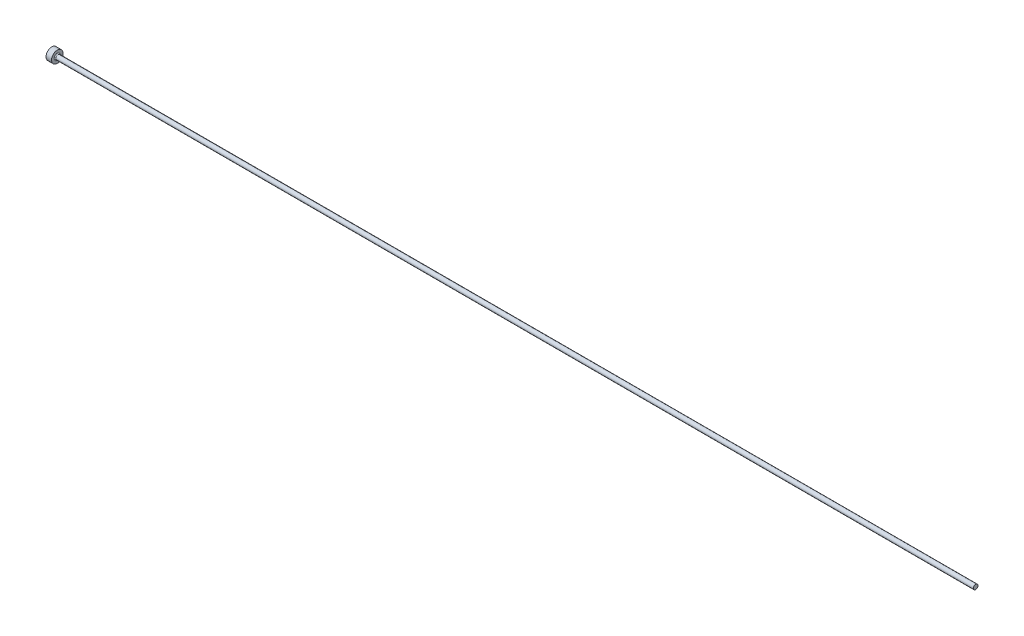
ISO-10303-21;
HEADER;
FILE_DESCRIPTION(('STEP AP214'),'2;1');
FILE_NAME('part.step','',(''),(''),'','','');
FILE_SCHEMA(('AUTOMOTIVE_DESIGN { 1 0 10303 214 1 1 1 1 }'));
ENDSEC;
DATA;
#1=APPLICATION_CONTEXT('core data for automotive mechanical design processes');
#2=APPLICATION_PROTOCOL_DEFINITION('international standard','automotive_design',2000,#1);
#3=PRODUCT_CONTEXT('',#1,'mechanical');
#4=PRODUCT('Part','Part','',(#3));
#5=PRODUCT_RELATED_PRODUCT_CATEGORY('part','',(#4));
#6=PRODUCT_DEFINITION_FORMATION('','',#4);
#7=PRODUCT_DEFINITION_CONTEXT('part definition',#1,'design');
#8=PRODUCT_DEFINITION('design','',#6,#7);
#9=PRODUCT_DEFINITION_SHAPE('','',#8);
#10=(LENGTH_UNIT() NAMED_UNIT(*) SI_UNIT(.MILLI.,.METRE.));
#11=(NAMED_UNIT(*) PLANE_ANGLE_UNIT() SI_UNIT($,.RADIAN.));
#12=(NAMED_UNIT(*) SI_UNIT($,.STERADIAN.) SOLID_ANGLE_UNIT());
#13=UNCERTAINTY_MEASURE_WITH_UNIT(LENGTH_MEASURE(1.E-05),#10,'distance_accuracy_value','');
#14=(GEOMETRIC_REPRESENTATION_CONTEXT(3) GLOBAL_UNCERTAINTY_ASSIGNED_CONTEXT((#13)) GLOBAL_UNIT_ASSIGNED_CONTEXT((#10,
#11,#12)) REPRESENTATION_CONTEXT('',''));
#15=CARTESIAN_POINT('',(0.,0.,0.));
#16=DIRECTION('',(0.,0.,1.));
#17=DIRECTION('',(1.,0.,0.));
#18=AXIS2_PLACEMENT_3D('',#15,#16,#17);
#19=CARTESIAN_POINT('',(0.,0.,0.));
#20=DIRECTION('',(-1.,0.,0.));
#21=DIRECTION('',(0.,-1.,0.));
#22=AXIS2_PLACEMENT_3D('',#19,#20,#21);
#23=PLANE('',#22);
#24=CARTESIAN_POINT('',(0.,0.,0.));
#25=DIRECTION('',(1.,0.,0.));
#26=DIRECTION('',(0.,1.,0.));
#27=AXIS2_PLACEMENT_3D('',#24,#25,#26);
#28=CIRCLE('',#27,1.25);
#29=CARTESIAN_POINT('',(0.,1.25,0.));
#30=VERTEX_POINT('',#29);
#31=EDGE_CURVE('E25',#30,#30,#28,.T.);
#32=ORIENTED_EDGE('',*,*,#31,.F.);
#33=EDGE_LOOP('',(#32));
#34=FACE_BOUND('',#33,.T.);
#35=ADVANCED_FACE('F14',(#34),#23,.T.);
#36=CARTESIAN_POINT('',(200.,0.,0.));
#37=DIRECTION('',(1.,0.,0.));
#38=DIRECTION('',(0.,1.,0.));
#39=AXIS2_PLACEMENT_3D('',#36,#37,#38);
#40=CYLINDRICAL_SURFACE('',#39,1.25);
#41=ORIENTED_EDGE('',*,*,#31,.T.);
#42=EDGE_LOOP('',(#41));
#43=FACE_BOUND('',#42,.T.);
#44=CARTESIAN_POINT('',(1.2,0.,0.));
#45=DIRECTION('',(1.,0.,0.));
#46=DIRECTION('',(0.,1.,0.));
#47=AXIS2_PLACEMENT_3D('',#44,#45,#46);
#48=CIRCLE('',#47,1.25);
#49=CARTESIAN_POINT('',(1.2,1.25,0.));
#50=VERTEX_POINT('',#49);
#51=EDGE_CURVE('E29',#50,#50,#48,.T.);
#52=ORIENTED_EDGE('',*,*,#51,.F.);
#53=EDGE_LOOP('',(#52));
#54=FACE_BOUND('',#53,.T.);
#55=ADVANCED_FACE('F51',(#43,#54),#40,.T.);
#56=CARTESIAN_POINT('',(1.2,1.25,0.));
#57=DIRECTION('',(1.,0.,0.));
#58=DIRECTION('',(0.,1.,0.));
#59=AXIS2_PLACEMENT_3D('',#56,#57,#58);
#60=PLANE('',#59);
#61=CARTESIAN_POINT('',(1.2,0.,0.));
#62=DIRECTION('',(1.,0.,0.));
#63=DIRECTION('',(0.,1.,0.));
#64=AXIS2_PLACEMENT_3D('',#61,#62,#63);
#65=CIRCLE('',#64,0.69999999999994);
#66=CARTESIAN_POINT('',(1.2,0.69999999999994,0.));
#67=VERTEX_POINT('',#66);
#68=EDGE_CURVE('E9',#67,#67,#65,.F.);
#69=ORIENTED_EDGE('',*,*,#68,.T.);
#70=EDGE_LOOP('',(#69));
#71=FACE_BOUND('',#70,.T.);
#72=ORIENTED_EDGE('',*,*,#51,.T.);
#73=EDGE_LOOP('',(#72));
#74=FACE_BOUND('',#73,.T.);
#75=ADVANCED_FACE('F42',(#71,#74),#60,.T.);
#76=CARTESIAN_POINT('',(200.,0.,0.));
#77=DIRECTION('',(1.,0.,0.));
#78=DIRECTION('',(0.,1.,0.));
#79=AXIS2_PLACEMENT_3D('',#76,#77,#78);
#80=CYLINDRICAL_SURFACE('',#79,0.49999999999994);
#81=CARTESIAN_POINT('',(1.40000000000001,0.,0.));
#82=DIRECTION('',(1.,0.,0.));
#83=DIRECTION('',(0.,1.,0.));
#84=AXIS2_PLACEMENT_3D('',#81,#82,#83);
#85=CIRCLE('',#84,0.49999999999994);
#86=CARTESIAN_POINT('',(1.40000000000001,0.49999999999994,0.));
#87=VERTEX_POINT('',#86);
#88=EDGE_CURVE('E21',#87,#87,#85,.T.);
#89=ORIENTED_EDGE('',*,*,#88,.T.);
#90=EDGE_LOOP('',(#89));
#91=FACE_BOUND('',#90,.T.);
#92=CARTESIAN_POINT('',(200.,0.,0.));
#93=DIRECTION('',(1.,0.,0.));
#94=DIRECTION('',(0.,1.,0.));
#95=AXIS2_PLACEMENT_3D('',#92,#93,#94);
#96=CIRCLE('',#95,0.499999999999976);
#97=CARTESIAN_POINT('',(200.,0.499999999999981,0.));
#98=VERTEX_POINT('',#97);
#99=EDGE_CURVE('E34',#98,#98,#96,.T.);
#100=ORIENTED_EDGE('',*,*,#99,.F.);
#101=EDGE_LOOP('',(#100));
#102=FACE_BOUND('',#101,.T.);
#103=ADVANCED_FACE('F40',(#91,#102),#80,.T.);
#104=CARTESIAN_POINT('',(200.,0.499999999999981,0.));
#105=DIRECTION('',(1.,0.,0.));
#106=DIRECTION('',(0.,1.,0.));
#107=AXIS2_PLACEMENT_3D('',#104,#105,#106);
#108=PLANE('',#107);
#109=ORIENTED_EDGE('',*,*,#99,.T.);
#110=EDGE_LOOP('',(#109));
#111=FACE_BOUND('',#110,.T.);
#112=ADVANCED_FACE('F38',(#111),#108,.T.);
#113=CARTESIAN_POINT('',(1.40000000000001,0.,0.));
#114=DIRECTION('',(1.,0.,0.));
#115=DIRECTION('',(0.,1.,0.));
#116=AXIS2_PLACEMENT_3D('',#113,#114,#115);
#117=TOROIDAL_SURFACE('',#116,0.69999999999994,0.2);
#118=ORIENTED_EDGE('',*,*,#68,.F.);
#119=EDGE_LOOP('',(#118));
#120=FACE_BOUND('',#119,.T.);
#121=ORIENTED_EDGE('',*,*,#88,.F.);
#122=EDGE_LOOP('',(#121));
#123=FACE_BOUND('',#122,.T.);
#124=ADVANCED_FACE('F16',(#120,#123),#117,.F.);
#125=CLOSED_SHELL('',(#35,#55,#75,#103,#112,#124));
#126=MANIFOLD_SOLID_BREP('B1',#125);
#127=ADVANCED_BREP_SHAPE_REPRESENTATION('',(#18,#126),#14);
#128=SHAPE_DEFINITION_REPRESENTATION(#9,#127);
ENDSEC;
END-ISO-10303-21;
